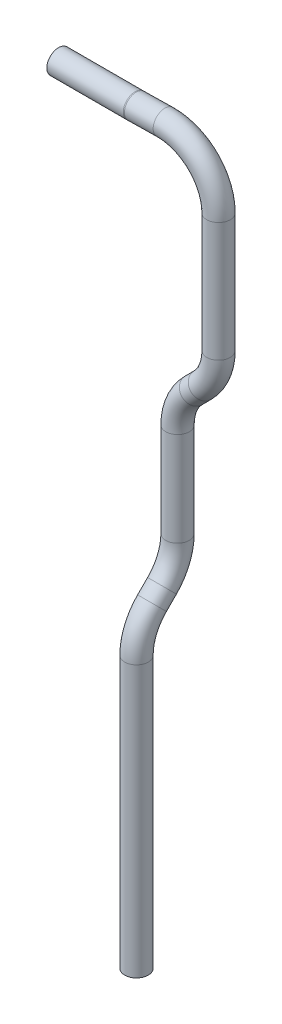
from build123d import *

# Parameters (mm, degrees)
SKETCH2_R   = 3.175
SKETCH2_R_2 = 2.54


with BuildPart() as part:
    # Sweep1: sweep along a curve in space
    with BuildLine() as sweep1_path:
        Line((0, 0, 0), (20.6375, 0, 0))
        ThreePointArc((20.6375, 0, 0), (20.762180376, 0, -0.000544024), (20.886851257, 0, -0.002176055))
        Line((20.886851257, 0, -0.002176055), (28.505690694, 0, -0.135163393))
        ThreePointArc((28.505690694, 0, -0.135163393), (38.606940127, -4.184711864, -0.311481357), (42.791014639, -14.2875, -0.384514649))
        Line((42.791014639, -14.2875, -0.384514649), (42.791014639, -46.469423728, -0.384514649))
        ThreePointArc((42.791014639, -46.469423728, -0.384514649), (41.704146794, -51.937013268, -0.345407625), (38.609009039, -56.572211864, -0.234040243))
        Line((38.609009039, -56.572211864, -0.234040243), (36.286535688, -58.896188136, -0.150474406))
        ThreePointArc((36.286535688, -58.896188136, -0.150474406), (33.191397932, -63.531386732, -0.039107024), (32.104530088, -68.998976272, 0))
        Line((32.104530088, -68.998976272, 0), (32.104530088, -94.398976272, 0))
        ThreePointArc((32.104530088, -94.398976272, 0), (32.104530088, -99.866565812, 1.087571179), (32.104530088, -104.501764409, 4.184711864))
        Line((32.104530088, -104.501764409, 4.184711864), (32.104530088, -107.206740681, 6.889688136))
        ThreePointArc((32.104530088, -107.206740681, 6.889688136), (32.104530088, -111.841939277, 9.986828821), (32.104530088, -117.309528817, 11.0744))
        Line((32.104530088, -117.309528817, 11.0744), (32.104530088, -190.5, 11.0744))
    # Sketch2 → Sweep1 (sweep)
    with BuildSketch(Plane(origin=(0, 0, 0), x_dir=(0, 0, -1), z_dir=(1, 0, 0))):
        Circle(SKETCH2_R)
        Circle(SKETCH2_R_2, mode=Mode.SUBTRACT)
    sweep(path=sweep1_path.line)


solid = part.part
